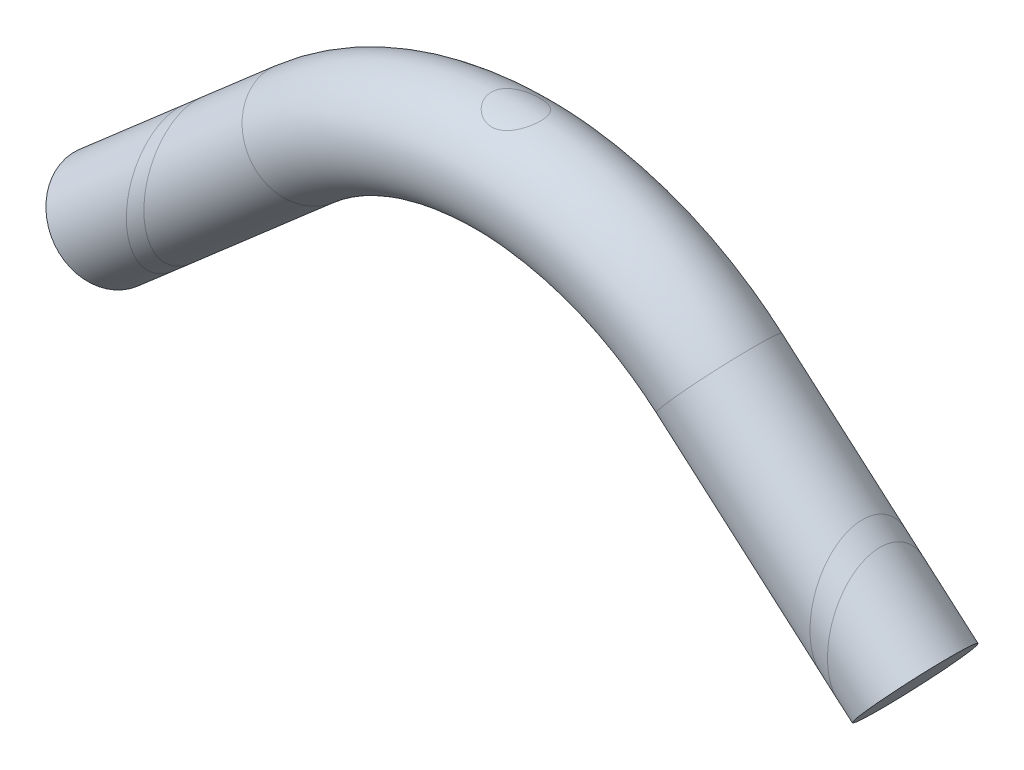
ISO-10303-21;
HEADER;
FILE_DESCRIPTION(('STEP AP214'),'2;1');
FILE_NAME('part.step','',(''),(''),'','','');
FILE_SCHEMA(('AUTOMOTIVE_DESIGN { 1 0 10303 214 1 1 1 1 }'));
ENDSEC;
DATA;
#1=APPLICATION_CONTEXT('core data for automotive mechanical design processes');
#2=APPLICATION_PROTOCOL_DEFINITION('international standard','automotive_design',2000,#1);
#3=PRODUCT_CONTEXT('',#1,'mechanical');
#4=PRODUCT('Part','Part','',(#3));
#5=PRODUCT_RELATED_PRODUCT_CATEGORY('part','',(#4));
#6=PRODUCT_DEFINITION_FORMATION('','',#4);
#7=PRODUCT_DEFINITION_CONTEXT('part definition',#1,'design');
#8=PRODUCT_DEFINITION('design','',#6,#7);
#9=PRODUCT_DEFINITION_SHAPE('','',#8);
#10=(LENGTH_UNIT() NAMED_UNIT(*) SI_UNIT(.MILLI.,.METRE.));
#11=(NAMED_UNIT(*) PLANE_ANGLE_UNIT() SI_UNIT($,.RADIAN.));
#12=(NAMED_UNIT(*) SI_UNIT($,.STERADIAN.) SOLID_ANGLE_UNIT());
#13=UNCERTAINTY_MEASURE_WITH_UNIT(LENGTH_MEASURE(1.E-05),#10,'distance_accuracy_value','');
#14=(GEOMETRIC_REPRESENTATION_CONTEXT(3) GLOBAL_UNCERTAINTY_ASSIGNED_CONTEXT((#13)) GLOBAL_UNIT_ASSIGNED_CONTEXT((#10,
#11,#12)) REPRESENTATION_CONTEXT('',''));
#15=CARTESIAN_POINT('',(0.,0.,0.));
#16=DIRECTION('',(0.,0.,1.));
#17=DIRECTION('',(1.,0.,0.));
#18=AXIS2_PLACEMENT_3D('',#15,#16,#17);
#19=CARTESIAN_POINT('',(174.056084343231,48.6468831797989,0.));
#20=DIRECTION('',(0.754605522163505,-0.656178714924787,0.));
#21=DIRECTION('',(0.656178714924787,0.754605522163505,0.));
#22=AXIS2_PLACEMENT_3D('',#19,#20,#21);
#23=CYLINDRICAL_SURFACE('',#22,15.);
#24=CARTESIAN_POINT('',(215.,13.0434782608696,0.));
#25=DIRECTION('',(1.,0.,0.));
#26=DIRECTION('',(0.,-1.,0.));
#27=AXIS2_PLACEMENT_3D('',#24,#25,#26);
#28=ELLIPSE('',#27,19.8779356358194,15.);
#29=CARTESIAN_POINT('',(215.,-6.8344573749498,0.));
#30=VERTEX_POINT('',#29);
#31=EDGE_CURVE('E44',#30,#30,#28,.F.);
#32=ORIENTED_EDGE('',*,*,#31,.F.);
#33=EDGE_LOOP('',(#32));
#34=FACE_BOUND('',#33,.T.);
#35=CARTESIAN_POINT('',(220.,8.69565217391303,0.));
#36=DIRECTION('',(1.,0.,0.));
#37=DIRECTION('',(0.,-1.,0.));
#38=AXIS2_PLACEMENT_3D('',#35,#36,#37);
#39=ELLIPSE('',#38,19.8779356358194,15.);
#40=CARTESIAN_POINT('',(220.,-11.1822834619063,0.));
#41=VERTEX_POINT('',#40);
#42=EDGE_CURVE('E10',#41,#41,#39,.F.);
#43=ORIENTED_EDGE('',*,*,#42,.T.);
#44=EDGE_LOOP('',(#43));
#45=FACE_BOUND('',#44,.T.);
#46=ADVANCED_FACE('F36',(#34,#45),#23,.T.);
#47=CARTESIAN_POINT('',(174.056084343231,48.6468831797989,0.));
#48=DIRECTION('',(0.754605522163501,-0.656178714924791,0.));
#49=DIRECTION('',(0.,0.,-1.));
#50=AXIS2_PLACEMENT_3D('',#47,#48,#49);
#51=CIRCLE('',#50,15.);
#52=CARTESIAN_POINT('',(174.056084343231,48.6468831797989,-15.));
#53=VERTEX_POINT('',#52);
#54=EDGE_CURVE('E118',#53,#53,#51,.T.);
#55=ORIENTED_EDGE('',*,*,#54,.T.);
#56=EDGE_LOOP('',(#55));
#57=FACE_BOUND('',#56,.T.);
#58=ORIENTED_EDGE('',*,*,#31,.T.);
#59=EDGE_LOOP('',(#58));
#60=FACE_BOUND('',#59,.T.);
#61=ADVANCED_FACE('F100',(#57,#60),#23,.T.);
#62=CARTESIAN_POINT('',(55.9439156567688,48.6468831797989,0.));
#63=DIRECTION('',(-0.754605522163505,-0.656178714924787,0.));
#64=DIRECTION('',(0.656178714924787,-0.754605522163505,0.));
#65=AXIS2_PLACEMENT_3D('',#62,#63,#64);
#66=CYLINDRICAL_SURFACE('',#65,15.);
#67=CARTESIAN_POINT('',(20.,17.3913043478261,0.));
#68=DIRECTION('',(1.,0.,0.));
#69=DIRECTION('',(0.,-1.,0.));
#70=AXIS2_PLACEMENT_3D('',#67,#68,#69);
#71=ELLIPSE('',#70,19.8779356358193,15.);
#72=CARTESIAN_POINT('',(20.,-2.48663128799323,0.));
#73=VERTEX_POINT('',#72);
#74=EDGE_CURVE('E59',#73,#73,#71,.T.);
#75=ORIENTED_EDGE('',*,*,#74,.T.);
#76=EDGE_LOOP('',(#75));
#77=FACE_BOUND('',#76,.T.);
#78=CARTESIAN_POINT('',(25.,21.7391304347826,0.));
#79=DIRECTION('',(1.,0.,0.));
#80=DIRECTION('',(0.,-1.,0.));
#81=AXIS2_PLACEMENT_3D('',#78,#79,#80);
#82=ELLIPSE('',#81,19.8779356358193,15.);
#83=CARTESIAN_POINT('',(25.,1.86119479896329,0.));
#84=VERTEX_POINT('',#83);
#85=EDGE_CURVE('E51',#84,#84,#82,.T.);
#86=ORIENTED_EDGE('',*,*,#85,.F.);
#87=EDGE_LOOP('',(#86));
#88=FACE_BOUND('',#87,.T.);
#89=ADVANCED_FACE('F90',(#77,#88),#66,.T.);
#90=CARTESIAN_POINT('',(0.,0.,0.));
#91=DIRECTION('',(0.7546055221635,0.656178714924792,0.));
#92=DIRECTION('',(0.,0.,-1.));
#93=AXIS2_PLACEMENT_3D('',#90,#91,#92);
#94=CIRCLE('',#93,15.);
#95=CARTESIAN_POINT('',(0.,0.,-15.));
#96=VERTEX_POINT('',#95);
#97=EDGE_CURVE('E72',#96,#96,#94,.T.);
#98=ORIENTED_EDGE('',*,*,#97,.T.);
#99=EDGE_LOOP('',(#98));
#100=FACE_BOUND('',#99,.T.);
#101=ORIENTED_EDGE('',*,*,#74,.F.);
#102=EDGE_LOOP('',(#101));
#103=FACE_BOUND('',#102,.T.);
#104=ADVANCED_FACE('F91',(#100,#103),#66,.T.);
#105=CARTESIAN_POINT('',(115.,-19.2676138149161,0.));
#106=DIRECTION('',(0.,0.,-1.));
#107=DIRECTION('',(-1.,0.,0.));
#108=AXIS2_PLACEMENT_3D('',#105,#106,#107);
#109=TOROIDAL_SURFACE('',#108,90.,15.);
#110=CARTESIAN_POINT('',(110.588080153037,85.0106860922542,-4.2962066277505));
#111=CARTESIAN_POINT('',(110.710333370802,84.9688042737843,-4.4534690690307));
#112=CARTESIAN_POINT('',(110.839197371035,84.9257780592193,-4.60537547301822));
#113=CARTESIAN_POINT('',(111.1092662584,84.8385685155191,-4.89755901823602));
#114=CARTESIAN_POINT('',(111.250478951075,84.7943844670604,-5.03782869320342));
#115=CARTESIAN_POINT('',(111.544722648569,84.7059378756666,-5.30620513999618));
#116=CARTESIAN_POINT('',(111.697783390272,84.6616754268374,-5.43427938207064));
#117=CARTESIAN_POINT('',(112.014505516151,84.5744150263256,-5.67705037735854));
#118=CARTESIAN_POINT('',(112.1781667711,84.5314170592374,-5.7917472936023));
#119=CARTESIAN_POINT('',(112.515366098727,84.4478828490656,-6.00711752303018));
#120=CARTESIAN_POINT('',(112.688915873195,84.4073496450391,-6.10777371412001));
#121=CARTESIAN_POINT('',(113.044595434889,84.3300760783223,-6.29406440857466));
#122=CARTESIAN_POINT('',(113.226720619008,84.2933337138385,-6.37970685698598));
#123=CARTESIAN_POINT('',(113.598324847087,84.2248607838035,-6.53519724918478));
#124=CARTESIAN_POINT('',(113.787797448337,84.1931259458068,-6.60505867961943));
#125=CARTESIAN_POINT('',(114.172914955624,84.1357511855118,-6.72834766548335));
#126=CARTESIAN_POINT('',(114.36855940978,84.1101108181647,-6.78177642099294));
#127=CARTESIAN_POINT('',(114.755652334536,84.0668680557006,-6.8695575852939));
#128=CARTESIAN_POINT('',(114.946897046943,84.0489574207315,-6.90465638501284));
#129=CARTESIAN_POINT('',(115.332170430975,84.020196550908,-6.95885151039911));
#130=CARTESIAN_POINT('',(115.526199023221,84.0093461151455,-6.97794829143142));
#131=CARTESIAN_POINT('',(115.915391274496,83.9950818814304,-6.99987763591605));
#132=CARTESIAN_POINT('',(116.110554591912,83.9916659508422,-7.00271486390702));
#133=CARTESIAN_POINT('',(116.500417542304,83.9923464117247,-6.99207973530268));
#134=CARTESIAN_POINT('',(116.695117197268,83.9964424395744,-6.97860816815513));
#135=CARTESIAN_POINT('',(117.067728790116,84.0113360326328,-6.93714730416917));
#136=CARTESIAN_POINT('',(117.245794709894,84.0216021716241,-6.91033566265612));
#137=CARTESIAN_POINT('',(117.598975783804,84.0479765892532,-6.84317181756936));
#138=CARTESIAN_POINT('',(117.774089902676,84.0640868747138,-6.80281496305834));
#139=CARTESIAN_POINT('',(118.120129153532,84.1015870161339,-6.70895336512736));
#140=CARTESIAN_POINT('',(118.291055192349,84.1229757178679,-6.65545149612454));
#141=CARTESIAN_POINT('',(118.627805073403,84.1703534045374,-6.53573510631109));
#142=CARTESIAN_POINT('',(118.793626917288,84.1963441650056,-6.46951567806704));
#143=CARTESIAN_POINT('',(119.123873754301,84.2529417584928,-6.3228119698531));
#144=CARTESIAN_POINT('',(119.28812184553,84.2836597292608,-6.24197261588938));
#145=CARTESIAN_POINT('',(119.609366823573,84.3482341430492,-6.06795742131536));
#146=CARTESIAN_POINT('',(119.766361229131,84.3820916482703,-5.97477740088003));
#147=CARTESIAN_POINT('',(120.072280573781,84.4520067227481,-5.7766867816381));
#148=CARTESIAN_POINT('',(120.221204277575,84.4880646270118,-5.67177439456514));
#149=CARTESIAN_POINT('',(120.510238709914,84.5614402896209,-5.4508349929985));
#150=CARTESIAN_POINT('',(120.65034900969,84.5987581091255,-5.33480743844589));
#151=CARTESIAN_POINT('',(120.9322498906,84.6768284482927,-5.08223563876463));
#152=CARTESIAN_POINT('',(121.073224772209,84.7176102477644,-4.94478843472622));
#153=CARTESIAN_POINT('',(121.343156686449,84.798425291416,-4.65844140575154));
#154=CARTESIAN_POINT('',(121.472117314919,84.8384587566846,-4.50954503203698));
#155=CARTESIAN_POINT('',(121.71730888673,84.9167306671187,-4.20103378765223));
#156=CARTESIAN_POINT('',(121.833533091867,84.9549681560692,-4.04141331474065));
#157=CARTESIAN_POINT('',(122.052303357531,85.0285885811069,-3.71252862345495));
#158=CARTESIAN_POINT('',(122.154855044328,85.0639726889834,-3.54326841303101));
#159=CARTESIAN_POINT('',(122.346717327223,85.1313755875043,-3.19392038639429));
#160=CARTESIAN_POINT('',(122.435847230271,85.1633470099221,-3.01372402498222));
#161=CARTESIAN_POINT('',(122.598482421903,85.2225141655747,-2.64573895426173));
#162=CARTESIAN_POINT('',(122.671994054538,85.2497118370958,-2.45795336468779));
#163=CARTESIAN_POINT('',(122.802698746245,85.2985764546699,-2.07611951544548));
#164=CARTESIAN_POINT('',(122.859894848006,85.320244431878,-1.88207243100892));
#165=CARTESIAN_POINT('',(122.957367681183,85.3574319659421,-1.48919977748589));
#166=CARTESIAN_POINT('',(122.997645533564,85.3729519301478,-1.29037452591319));
#167=CARTESIAN_POINT('',(123.058913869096,85.3966527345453,-0.901706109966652));
#168=CARTESIAN_POINT('',(123.080923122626,85.4052205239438,-0.712046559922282));
#169=CARTESIAN_POINT('',(123.109372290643,85.4163072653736,-0.331389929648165));
#170=CARTESIAN_POINT('',(123.115812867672,85.4188264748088,-0.140392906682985));
#171=CARTESIAN_POINT('',(123.113056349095,85.4177499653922,0.241433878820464));
#172=CARTESIAN_POINT('',(123.10386215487,85.4141553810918,0.432263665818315));
#173=CARTESIAN_POINT('',(123.069940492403,85.4009480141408,0.81232491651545));
#174=CARTESIAN_POINT('',(123.045213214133,85.391335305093,1.00155639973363));
#175=CARTESIAN_POINT('',(122.981706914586,85.3668148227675,1.36992080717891));
#176=CARTESIAN_POINT('',(122.943492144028,85.3521200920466,1.54916566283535));
#177=CARTESIAN_POINT('',(122.853261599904,85.3177364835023,1.90371771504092));
#178=CARTESIAN_POINT('',(122.801241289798,85.2980459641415,2.07902359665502));
#179=CARTESIAN_POINT('',(122.683878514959,85.2541417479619,2.42447362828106));
#180=CARTESIAN_POINT('',(122.618539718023,85.2299292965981,2.59461918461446));
#181=CARTESIAN_POINT('',(122.475036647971,85.1775264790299,2.92884814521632));
#182=CARTESIAN_POINT('',(122.396867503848,85.1493346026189,3.09292921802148));
#183=CARTESIAN_POINT('',(122.225485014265,85.0886207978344,3.41941645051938));
#184=CARTESIAN_POINT('',(122.131856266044,85.0559856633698,3.58158346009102));
#185=CARTESIAN_POINT('',(121.932185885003,84.9879273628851,3.89754163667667));
#186=CARTESIAN_POINT('',(121.826139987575,84.9525032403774,4.05132989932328));
#187=CARTESIAN_POINT('',(121.602331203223,84.8797145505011,4.34968686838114));
#188=CARTESIAN_POINT('',(121.484566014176,84.8423496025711,4.49425375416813));
#189=CARTESIAN_POINT('',(121.238034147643,84.7665831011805,4.77339229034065));
#190=CARTESIAN_POINT('',(121.109267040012,84.7281815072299,4.90796354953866));
#191=CARTESIAN_POINT('',(120.83296549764,84.6488510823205,5.17458545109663));
#192=CARTESIAN_POINT('',(120.68475926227,84.6079159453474,5.30593902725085));
#193=CARTESIAN_POINT('',(120.377627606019,84.5271266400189,5.55570944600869));
#194=CARTESIAN_POINT('',(120.218705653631,84.4872721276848,5.67413044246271));
#195=CARTESIAN_POINT('',(119.89091851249,84.4098115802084,5.89736247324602));
#196=CARTESIAN_POINT('',(119.722048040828,84.3722067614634,6.00216618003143));
#197=CARTESIAN_POINT('',(119.375507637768,84.3004965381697,6.19726639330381));
#198=CARTESIAN_POINT('',(119.197841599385,84.2663896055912,6.28756924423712));
#199=CARTESIAN_POINT('',(118.834269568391,84.2027551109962,6.45317700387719));
#200=CARTESIAN_POINT('',(118.648343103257,84.1732398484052,6.5284417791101));
#201=CARTESIAN_POINT('',(118.270045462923,84.1200229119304,6.6629125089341));
#202=CARTESIAN_POINT('',(118.077677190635,84.0963186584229,6.72212559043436));
#203=CARTESIAN_POINT('',(117.687969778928,84.0556852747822,6.82386208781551));
#204=CARTESIAN_POINT('',(117.490633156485,84.0387527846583,6.86639378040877));
#205=CARTESIAN_POINT('',(117.092538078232,84.01239764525,6.93429383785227));
#206=CARTESIAN_POINT('',(116.891779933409,84.0029743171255,6.95966375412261));
#207=CARTESIAN_POINT('',(116.504768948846,83.9925301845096,6.99159556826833));
#208=CARTESIAN_POINT('',(116.318642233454,83.990896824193,6.99950115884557));
#209=CARTESIAN_POINT('',(115.94641886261,83.9944771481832,7.00045299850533));
#210=CARTESIAN_POINT('',(115.760322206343,83.9996905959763,6.99349976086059));
#211=CARTESIAN_POINT('',(115.389592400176,84.0168226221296,6.96483359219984));
#212=CARTESIAN_POINT('',(115.204959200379,84.0287409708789,6.94312116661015));
#213=CARTESIAN_POINT('',(114.838509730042,84.0589036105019,6.88519875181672));
#214=CARTESIAN_POINT('',(114.656693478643,84.0771479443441,6.84898866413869));
#215=CARTESIAN_POINT('',(114.3028996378,84.1187028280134,6.76385396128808));
#216=CARTESIAN_POINT('',(114.130793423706,84.1418324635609,6.7153735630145));
#217=CARTESIAN_POINT('',(113.791370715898,84.1928110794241,6.60563055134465));
#218=CARTESIAN_POINT('',(113.624055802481,84.2206615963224,6.54436377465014));
#219=CARTESIAN_POINT('',(113.295192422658,84.2803103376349,6.40955658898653));
#220=CARTESIAN_POINT('',(113.133643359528,84.3121081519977,6.3360174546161));
#221=CARTESIAN_POINT('',(112.817077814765,84.3788300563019,6.17718672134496));
#222=CARTESIAN_POINT('',(112.66206372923,84.4137552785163,6.09189085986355));
#223=CARTESIAN_POINT('',(112.185889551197,84.527199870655,5.80590071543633));
#224=CARTESIAN_POINT('',(111.877636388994,84.6098627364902,5.58486502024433));
#225=CARTESIAN_POINT('',(111.300992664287,84.7771921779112,5.09626568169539));
#226=CARTESIAN_POINT('',(111.032618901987,84.8618595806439,4.82868253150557));
#227=CARTESIAN_POINT('',(110.656758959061,84.9868457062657,4.38774965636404));
#228=CARTESIAN_POINT('',(110.532732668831,85.0293850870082,4.22886253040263));
#229=CARTESIAN_POINT('',(110.298553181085,85.1116147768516,3.90051516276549));
#230=CARTESIAN_POINT('',(110.188394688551,85.1513061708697,3.73105899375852));
#231=CARTESIAN_POINT('',(109.982792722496,85.2267917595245,3.38255586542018));
#232=CARTESIAN_POINT('',(109.887353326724,85.2625848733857,3.20350626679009));
#233=CARTESIAN_POINT('',(109.712122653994,85.3292764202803,2.83712420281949));
#234=CARTESIAN_POINT('',(109.632323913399,85.3601771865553,2.64979574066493));
#235=CARTESIAN_POINT('',(109.491432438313,85.4153422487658,2.27427805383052));
#236=CARTESIAN_POINT('',(109.429820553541,85.4397880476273,2.08631035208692));
#237=CARTESIAN_POINT('',(109.322620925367,85.4826476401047,1.70526817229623));
#238=CARTESIAN_POINT('',(109.277026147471,85.5010640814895,1.51219597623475));
#239=CARTESIAN_POINT('',(109.202346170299,85.531371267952,1.12244027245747));
#240=CARTESIAN_POINT('',(109.173255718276,85.5432640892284,0.925757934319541));
#241=CARTESIAN_POINT('',(109.131906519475,85.5602014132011,0.53034304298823));
#242=CARTESIAN_POINT('',(109.119646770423,85.5652463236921,0.331610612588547));
#243=CARTESIAN_POINT('',(109.112361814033,85.5682422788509,-0.0525573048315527));
#244=CARTESIAN_POINT('',(109.116211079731,85.5666566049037,-0.237968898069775));
#245=CARTESIAN_POINT('',(109.138590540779,85.5574650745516,-0.607752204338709));
#246=CARTESIAN_POINT('',(109.157120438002,85.5498593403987,-0.792123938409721));
#247=CARTESIAN_POINT('',(109.208680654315,85.5288071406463,-1.15857657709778));
#248=CARTESIAN_POINT('',(109.241717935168,85.5153578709,-1.3406563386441));
#249=CARTESIAN_POINT('',(109.321961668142,85.4829410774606,-1.70115684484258));
#250=CARTESIAN_POINT('',(109.369167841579,85.4639736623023,-1.87957766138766));
#251=CARTESIAN_POINT('',(109.476837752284,85.4211512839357,-2.23007003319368));
#252=CARTESIAN_POINT('',(109.537184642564,85.397339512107,-2.40218284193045));
#253=CARTESIAN_POINT('',(109.670873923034,85.345256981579,-2.74067575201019));
#254=CARTESIAN_POINT('',(109.744222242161,85.3169841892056,-2.9070531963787));
#255=CARTESIAN_POINT('',(109.903134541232,85.2566806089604,-3.23268376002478));
#256=CARTESIAN_POINT('',(109.988671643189,85.2246581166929,-3.3919515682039));
#257=CARTESIAN_POINT('',(110.171469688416,85.157496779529,-3.70290615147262));
#258=CARTESIAN_POINT('',(110.268728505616,85.1223585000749,-3.85459429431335));
#259=CARTESIAN_POINT('',(110.406347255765,85.0737364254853,-4.05208266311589));
#260=CARTESIAN_POINT('',(110.441822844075,85.0612916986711,-4.10159895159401));
#261=CARTESIAN_POINT('',(110.514020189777,85.0361622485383,-4.1996455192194));
#262=CARTESIAN_POINT('',(110.550741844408,85.0234775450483,-4.248175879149));
#263=CARTESIAN_POINT('',(110.588080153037,85.0106860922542,-4.2962066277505));
#264=B_SPLINE_CURVE_WITH_KNOTS('',3,(#110,#111,#112,#113,#114,#115,#116,#117,#118,#119,#120,
#121,#122,#123,#124,#125,#126,#127,#128,#129,#130,#131,#132,#133,#134,#135,#136,#137,#138,#139,
#140,#141,#142,#143,#144,#145,#146,#147,#148,#149,#150,#151,#152,#153,#154,#155,#156,#157,#158,
#159,#160,#161,#162,#163,#164,#165,#166,#167,#168,#169,#170,#171,#172,#173,#174,#175,#176,#177,
#178,#179,#180,#181,#182,#183,#184,#185,#186,#187,#188,#189,#190,#191,#192,#193,#194,#195,#196,
#197,#198,#199,#200,#201,#202,#203,#204,#205,#206,#207,#208,#209,#210,#211,#212,#213,#214,#215,
#216,#217,#218,#219,#220,#221,#222,#223,#224,#225,#226,#227,#228,#229,#230,#231,#232,#233,#234,
#235,#236,#237,#238,#239,#240,#241,#242,#243,#244,#245,#246,#247,#248,#249,#250,#251,#252,#253,
#254,#255,#256,#257,#258,#259,#260,#261,#262,#263),.UNSPECIFIED.,.T.,.F.,(4,2,2,2,2,2,2,2,2,2,2,
2,2,2,2,2,2,2,2,2,2,2,2,2,2,2,2,2,2,2,2,2,2,2,2,2,2,2,2,2,2,2,2,2,2,2,2,2,2,2,2,2,2,2,2,2,2,2,2,
2,2,2,2,2,2,2,2,2,2,2,2,2,2,2,2,2,4),(0.,0.610583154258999,1.22155508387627,1.83411354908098,
2.44666454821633,3.05995611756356,3.67292215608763,4.28536234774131,4.89775780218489,
5.4827606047,6.06774675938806,6.65256508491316,7.23735510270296,7.77782479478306,
8.31848025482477,8.85901759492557,9.39976393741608,9.9560409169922,10.5125067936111,
11.0690576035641,11.6256354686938,12.2281490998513,12.8304818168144,13.433131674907,
14.0355327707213,14.6454316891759,15.2550823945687,15.8646193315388,16.4741158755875,
17.0467669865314,17.6193937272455,18.1919142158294,18.7644277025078,19.3153806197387,
19.8665148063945,20.4174974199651,20.9686896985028,21.5382990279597,22.1081045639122,
22.678022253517,23.2479622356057,23.8539298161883,24.4597021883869,25.0657991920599,
25.6716302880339,26.2790572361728,26.8862140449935,27.49306922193,28.0998695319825,
28.6580674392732,29.216246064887,29.7744055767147,30.3325688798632,30.8728608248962,
31.4133289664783,31.9537410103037,32.4943495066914,33.6537163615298,34.8135702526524,
35.4309340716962,36.0480614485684,36.6653594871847,37.2823622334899,37.879517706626,
38.4764105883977,39.0731133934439,39.6697806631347,40.2254808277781,40.7811697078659,
41.3371255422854,41.8930704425,42.4442602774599,42.9957021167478,43.5459462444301,
44.0960907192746,44.2825890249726,44.4690719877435),.UNSPECIFIED.);
#265=CARTESIAN_POINT('',(110.588080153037,85.0106860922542,-4.2962066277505));
#266=VERTEX_POINT('',#265);
#267=EDGE_CURVE('E65',#266,#266,#264,.T.);
#268=ORIENTED_EDGE('',*,*,#267,.T.);
#269=EDGE_LOOP('',(#268));
#270=FACE_BOUND('',#269,.T.);
#271=CARTESIAN_POINT('',(55.9439156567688,48.6468831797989,0.));
#272=DIRECTION('',(0.7546055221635,0.656178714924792,0.));
#273=DIRECTION('',(0.,0.,-1.));
#274=AXIS2_PLACEMENT_3D('',#271,#272,#273);
#275=CIRCLE('',#274,15.);
#276=CARTESIAN_POINT('',(55.9439156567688,48.6468831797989,-15.));
#277=VERTEX_POINT('',#276);
#278=EDGE_CURVE('E122',#277,#277,#275,.T.);
#279=ORIENTED_EDGE('',*,*,#278,.T.);
#280=EDGE_LOOP('',(#279));
#281=FACE_BOUND('',#280,.T.);
#282=ORIENTED_EDGE('',*,*,#54,.F.);
#283=EDGE_LOOP('',(#282));
#284=FACE_BOUND('',#283,.T.);
#285=CARTESIAN_POINT('',(109.933391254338,55.9260523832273,-3.28518633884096));
#286=CARTESIAN_POINT('',(109.850554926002,55.885405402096,-3.12933368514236));
#287=CARTESIAN_POINT('',(109.773418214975,55.8468356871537,-2.96996870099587));
#288=CARTESIAN_POINT('',(109.631107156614,55.7747094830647,-2.64490910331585));
#289=CARTESIAN_POINT('',(109.565928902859,55.7411513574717,-2.47921657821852));
#290=CARTESIAN_POINT('',(109.448105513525,55.6798497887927,-2.14230960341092));
#291=CARTESIAN_POINT('',(109.395465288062,55.6521086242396,-1.97109302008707));
#292=CARTESIAN_POINT('',(109.30331881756,55.6031764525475,-1.62431099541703));
#293=CARTESIAN_POINT('',(109.26380711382,55.5819827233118,-1.44874739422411));
#294=CARTESIAN_POINT('',(109.19823362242,55.5466375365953,-1.09376995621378));
#295=CARTESIAN_POINT('',(109.172219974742,55.5325112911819,-0.914344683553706));
#296=CARTESIAN_POINT('',(109.134183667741,55.5118103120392,-0.553578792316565));
#297=CARTESIAN_POINT('',(109.122161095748,55.5052356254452,-0.372238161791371));
#298=CARTESIAN_POINT('',(109.112266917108,55.4998269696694,-0.0090883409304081));
#299=CARTESIAN_POINT('',(109.114392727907,55.5009915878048,0.172720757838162));
#300=CARTESIAN_POINT('',(109.132761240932,55.5110249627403,0.535405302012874));
#301=CARTESIAN_POINT('',(109.149003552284,55.5198935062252,0.716280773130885));
#302=CARTESIAN_POINT('',(109.194351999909,55.5445161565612,1.06766132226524));
#303=CARTESIAN_POINT('',(109.222850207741,55.5599445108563,1.23826836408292));
#304=CARTESIAN_POINT('',(109.292221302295,55.5972131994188,1.57629228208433));
#305=CARTESIAN_POINT('',(109.333098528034,55.6190557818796,1.74370801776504));
#306=CARTESIAN_POINT('',(109.42678661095,55.6686122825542,2.07422933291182));
#307=CARTESIAN_POINT('',(109.479595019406,55.6963249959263,2.23733578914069));
#308=CARTESIAN_POINT('',(109.596671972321,55.7569884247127,2.55843976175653));
#309=CARTESIAN_POINT('',(109.660945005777,55.7899411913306,2.71643524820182));
#310=CARTESIAN_POINT('',(109.803620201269,55.8619713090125,3.03363393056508));
#311=CARTESIAN_POINT('',(109.882536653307,55.9012607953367,3.19255779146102));
#312=CARTESIAN_POINT('',(110.051700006,55.9838618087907,3.50319043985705));
#313=CARTESIAN_POINT('',(110.141950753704,56.0271747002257,3.65489675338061));
#314=CARTESIAN_POINT('',(110.428795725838,56.1617269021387,4.09820480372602));
#315=CARTESIAN_POINT('',(110.64154113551,56.2576102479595,4.37812457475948));
#316=CARTESIAN_POINT('',(111.132614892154,56.4651011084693,4.93278331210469));
#317=CARTESIAN_POINT('',(111.415692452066,56.5772406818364,5.20313606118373));
#318=CARTESIAN_POINT('',(111.871962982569,56.7405613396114,5.5711918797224));
#319=CARTESIAN_POINT('',(112.029453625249,56.794223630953,5.68770192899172));
#320=CARTESIAN_POINT('',(112.354438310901,56.8984238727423,5.90758204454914));
#321=CARTESIAN_POINT('',(112.521933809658,56.9489613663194,6.01095019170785));
#322=CARTESIAN_POINT('',(112.872765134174,57.0472016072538,6.20744543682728));
#323=CARTESIAN_POINT('',(113.056463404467,57.094718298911,6.30001960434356));
#324=CARTESIAN_POINT('',(113.432595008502,57.1829107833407,6.46909885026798));
#325=CARTESIAN_POINT('',(113.625023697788,57.2235901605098,6.54561235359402));
#326=CARTESIAN_POINT('',(114.017158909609,57.2964360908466,6.68159298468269));
#327=CARTESIAN_POINT('',(114.216857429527,57.3286117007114,6.74107825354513));
#328=CARTESIAN_POINT('',(114.622039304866,57.3830352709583,6.84220611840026));
#329=CARTESIAN_POINT('',(114.827521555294,57.4052851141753,6.88385209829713));
#330=CARTESIAN_POINT('',(115.217354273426,57.4367328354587,6.94471296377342));
#331=CARTESIAN_POINT('',(115.401279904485,57.4471770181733,6.96602063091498));
#332=CARTESIAN_POINT('',(115.770527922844,57.4590600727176,6.99398833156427));
#333=CARTESIAN_POINT('',(115.955850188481,57.460499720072,7.00064962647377));
#334=CARTESIAN_POINT('',(116.326238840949,57.4542531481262,6.99925059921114));
#335=CARTESIAN_POINT('',(116.51130527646,57.4465690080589,6.99119363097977));
#336=CARTESIAN_POINT('',(116.87963072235,57.4223125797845,6.96052483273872));
#337=CARTESIAN_POINT('',(117.062889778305,57.4057405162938,6.93791337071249));
#338=CARTESIAN_POINT('',(117.40965439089,57.3661480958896,6.88119790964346));
#339=CARTESIAN_POINT('',(117.573445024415,57.3438482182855,6.84832112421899));
#340=CARTESIAN_POINT('',(117.897363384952,57.2929767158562,6.77123078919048));
#341=CARTESIAN_POINT('',(118.057489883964,57.2644030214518,6.72701349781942));
#342=CARTESIAN_POINT('',(118.530994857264,57.1703626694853,6.5780281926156));
#343=CARTESIAN_POINT('',(118.837722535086,57.09654962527,6.45688942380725));
#344=CARTESIAN_POINT('',(119.453484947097,56.9264219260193,6.16267158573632));
#345=CARTESIAN_POINT('',(119.760383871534,56.8287055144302,5.98598162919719));
#346=CARTESIAN_POINT('',(120.342251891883,56.6241435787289,5.59026743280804));
#347=CARTESIAN_POINT('',(120.617198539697,56.5172917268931,5.37121371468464));
#348=CARTESIAN_POINT('',(121.167239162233,56.2882922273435,4.86110788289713));
#349=CARTESIAN_POINT('',(121.43702584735,56.1660858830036,4.56427808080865));
#350=CARTESIAN_POINT('',(121.801980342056,55.9919702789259,4.08586020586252));
#351=CARTESIAN_POINT('',(121.917064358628,55.9354349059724,3.92075668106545));
#352=CARTESIAN_POINT('',(122.13321618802,55.8268803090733,3.58010025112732));
#353=CARTESIAN_POINT('',(122.234282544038,55.7748615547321,3.40454626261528));
#354=CARTESIAN_POINT('',(122.421895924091,55.6765783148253,3.04301517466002));
#355=CARTESIAN_POINT('',(122.508361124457,55.6303466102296,2.85698665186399));
#356=CARTESIAN_POINT('',(122.665069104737,55.5454021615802,2.47665936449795));
#357=CARTESIAN_POINT('',(122.735320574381,55.5066853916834,2.28236509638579));
#358=CARTESIAN_POINT('',(122.858640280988,55.4380433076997,1.88705594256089));
#359=CARTESIAN_POINT('',(122.911722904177,55.4081106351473,1.68604684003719));
#360=CARTESIAN_POINT('',(122.999939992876,55.3580485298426,1.27893799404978));
#361=CARTESIAN_POINT('',(123.035077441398,55.337917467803,1.07283910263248));
#362=CARTESIAN_POINT('',(123.083559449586,55.3100574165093,0.6836250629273));
#363=CARTESIAN_POINT('',(123.099083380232,55.3010902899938,0.500866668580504));
#364=CARTESIAN_POINT('',(123.115726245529,55.2914748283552,0.134483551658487));
#365=CARTESIAN_POINT('',(123.116846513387,55.2908257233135,-0.0491410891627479));
#366=CARTESIAN_POINT('',(123.104667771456,55.2978648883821,-0.415711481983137));
#367=CARTESIAN_POINT('',(123.091371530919,55.3055515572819,-0.598657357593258));
#368=CARTESIAN_POINT('',(123.050555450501,55.329033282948,-0.962422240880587));
#369=CARTESIAN_POINT('',(123.02303577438,55.3448282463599,-1.1432412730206));
#370=CARTESIAN_POINT('',(122.956437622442,55.3827706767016,-1.48944929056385));
#371=CARTESIAN_POINT('',(122.918249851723,55.4044256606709,-1.65506455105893));
#372=CARTESIAN_POINT('',(122.830226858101,55.4538864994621,-1.98225207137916));
#373=CARTESIAN_POINT('',(122.780387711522,55.4816944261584,-2.14382294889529));
#374=CARTESIAN_POINT('',(122.614127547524,55.5734192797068,-2.62099858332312));
#375=CARTESIAN_POINT('',(122.480912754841,55.6456673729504,-2.92932741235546));
#376=CARTESIAN_POINT('',(122.16266660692,55.8123722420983,-3.54250955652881));
#377=CARTESIAN_POINT('',(121.974502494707,55.90808679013,-3.84537433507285));
#378=CARTESIAN_POINT('',(121.556607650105,56.1100774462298,-4.41704614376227));
#379=CARTESIAN_POINT('',(121.326848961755,56.2163606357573,-4.68583006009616));
#380=CARTESIAN_POINT('',(120.798507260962,56.4445796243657,-5.21713390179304));
#381=CARTESIAN_POINT('',(120.494899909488,56.5668001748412,-5.47459651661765));
#382=CARTESIAN_POINT('',(120.008454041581,56.7424748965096,-5.82045871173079));
#383=CARTESIAN_POINT('',(119.841013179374,56.7997921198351,-5.92908201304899));
#384=CARTESIAN_POINT('',(119.496356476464,56.9102842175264,-6.13219508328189));
#385=CARTESIAN_POINT('',(119.319139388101,56.9634585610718,-6.22668304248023));
#386=CARTESIAN_POINT('',(118.952475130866,57.064925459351,-6.40223813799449));
#387=CARTESIAN_POINT('',(118.762861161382,57.1131080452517,-6.48302105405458));
#388=CARTESIAN_POINT('',(118.375727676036,57.2016966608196,-6.62797561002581));
#389=CARTESIAN_POINT('',(118.178212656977,57.242107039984,-6.69215654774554));
#390=CARTESIAN_POINT('',(117.77690577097,57.3135602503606,-6.80294567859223));
#391=CARTESIAN_POINT('',(117.573121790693,57.3446143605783,-6.84957504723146));
#392=CARTESIAN_POINT('',(117.160904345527,57.3961027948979,-6.9245316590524));
#393=CARTESIAN_POINT('',(116.952471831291,57.4165392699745,-6.95286260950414));
#394=CARTESIAN_POINT('',(116.561845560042,57.4438989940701,-6.98806225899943));
#395=CARTESIAN_POINT('',(116.379967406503,57.4522895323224,-6.99733876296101));
#396=CARTESIAN_POINT('',(116.01585647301,57.4602593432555,-7.00167005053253));
#397=CARTESIAN_POINT('',(115.833623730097,57.4598394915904,-6.99672624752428));
#398=CARTESIAN_POINT('',(115.470348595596,57.4502660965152,-6.97266497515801));
#399=CARTESIAN_POINT('',(115.289306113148,57.4411132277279,-6.95354860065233));
#400=CARTESIAN_POINT('',(114.929866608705,57.4144750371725,-6.90140193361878));
#401=CARTESIAN_POINT('',(114.751469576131,57.3969897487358,-6.86837169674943));
#402=CARTESIAN_POINT('',(114.411640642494,57.3559320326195,-6.79175506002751));
#403=CARTESIAN_POINT('',(114.249926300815,57.332902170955,-6.74912422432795));
#404=CARTESIAN_POINT('',(113.93079648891,57.2809746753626,-6.65272483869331));
#405=CARTESIAN_POINT('',(113.77338247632,57.2520750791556,-6.59895256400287));
#406=CARTESIAN_POINT('',(113.308815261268,57.1577552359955,-6.4216209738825));
#407=CARTESIAN_POINT('',(113.009179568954,57.084693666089,-6.28201092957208));
#408=CARTESIAN_POINT('',(112.405896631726,56.9171793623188,-5.94780617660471));
#409=CARTESIAN_POINT('',(112.104980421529,56.821302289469,-5.74904499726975));
#410=CARTESIAN_POINT('',(111.538416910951,56.6230240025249,-5.30913801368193));
#411=CARTESIAN_POINT('',(111.272766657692,56.520623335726,-5.06799576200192));
#412=CARTESIAN_POINT('',(110.81267729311,56.3314986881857,-4.58113048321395));
#413=CARTESIAN_POINT('',(110.613472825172,56.2444556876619,-4.34000639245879));
#414=CARTESIAN_POINT('',(110.247901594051,56.0780784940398,-3.83139325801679));
#415=CARTESIAN_POINT('',(110.08153211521,55.9987436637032,-3.56390639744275));
#416=CARTESIAN_POINT('',(109.933391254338,55.9260523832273,-3.28518633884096));
#417=B_SPLINE_CURVE_WITH_KNOTS('',3,(#285,#286,#287,#288,#289,#290,#291,#292,#293,#294,#295,
#296,#297,#298,#299,#300,#301,#302,#303,#304,#305,#306,#307,#308,#309,#310,#311,#312,#313,#314,
#315,#316,#317,#318,#319,#320,#321,#322,#323,#324,#325,#326,#327,#328,#329,#330,#331,#332,#333,
#334,#335,#336,#337,#338,#339,#340,#341,#342,#343,#344,#345,#346,#347,#348,#349,#350,#351,#352,
#353,#354,#355,#356,#357,#358,#359,#360,#361,#362,#363,#364,#365,#366,#367,#368,#369,#370,#371,
#372,#373,#374,#375,#376,#377,#378,#379,#380,#381,#382,#383,#384,#385,#386,#387,#388,#389,#390,
#391,#392,#393,#394,#395,#396,#397,#398,#399,#400,#401,#402,#403,#404,#405,#406,#407,#408,#409,
#410,#411,#412,#413,#414,#415,#416),.UNSPECIFIED.,.T.,.F.,(4,2,2,2,2,2,2,2,2,2,2,2,2,2,2,2,2,2,
2,2,2,2,2,2,2,2,2,2,2,2,2,2,2,2,2,2,2,2,2,2,2,2,2,2,2,2,2,2,2,2,2,2,2,2,2,2,2,2,2,2,2,2,2,2,2,
4),(0.,0.543124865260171,1.08607199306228,1.62923140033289,2.17216468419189,2.7170212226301,
3.26188116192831,3.80664164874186,4.35138705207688,4.87176476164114,5.39232508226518,
5.91277866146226,6.43343647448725,6.97806685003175,7.52288258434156,8.61208418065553,
9.82792244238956,10.4367184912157,11.045603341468,11.6781116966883,12.3102874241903,
12.9417871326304,13.5731669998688,14.1287430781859,14.6842713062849,15.2396729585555,
15.7950605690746,16.3001162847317,16.8053388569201,17.8151062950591,18.913017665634,
20.0116957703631,21.2633135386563,21.8898263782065,22.5164042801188,23.1463846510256,
23.7760265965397,24.4051395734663,25.0341479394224,25.5843230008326,26.1344471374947,
26.6844656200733,27.2344777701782,27.7479016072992,28.2614985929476,29.2878984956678,
30.3911445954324,31.4951349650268,32.7382405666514,33.3606085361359,33.9830561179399,
34.6171511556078,35.2508903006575,35.8838623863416,36.5167061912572,37.0628864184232,
37.6090123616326,38.1550961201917,38.7011776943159,39.2070780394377,39.7131477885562,
40.7248046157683,41.8400535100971,42.9552089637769,43.9265900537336,44.8978907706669),.UNSPECIFIED.);
#418=CARTESIAN_POINT('',(109.933391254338,55.9260523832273,-3.28518633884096));
#419=VERTEX_POINT('',#418);
#420=EDGE_CURVE('E64',#419,#419,#417,.T.);
#421=ORIENTED_EDGE('',*,*,#420,.T.);
#422=EDGE_LOOP('',(#421));
#423=FACE_BOUND('',#422,.T.);
#424=ADVANCED_FACE('F85',(#270,#281,#284,#423),#109,.T.);
#425=ORIENTED_EDGE('',*,*,#420,.F.);
#426=EDGE_LOOP('',(#425));
#427=FACE_BOUND('',#426,.T.);
#428=ADVANCED_FACE('F84',(#427),#109,.T.);
#429=ORIENTED_EDGE('',*,*,#85,.T.);
#430=EDGE_LOOP('',(#429));
#431=FACE_BOUND('',#430,.T.);
#432=ORIENTED_EDGE('',*,*,#278,.F.);
#433=EDGE_LOOP('',(#432));
#434=FACE_BOUND('',#433,.T.);
#435=ADVANCED_FACE('F82',(#431,#434),#66,.T.);
#436=ORIENTED_EDGE('',*,*,#267,.F.);
#437=EDGE_LOOP('',(#436));
#438=FACE_BOUND('',#437,.T.);
#439=ADVANCED_FACE('F77',(#438),#109,.T.);
#440=CARTESIAN_POINT('',(0.,0.,0.));
#441=DIRECTION('',(0.7546055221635,0.656178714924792,0.));
#442=DIRECTION('',(0.,0.,-1.));
#443=AXIS2_PLACEMENT_3D('',#440,#441,#442);
#444=PLANE('',#443);
#445=ORIENTED_EDGE('',*,*,#97,.F.);
#446=EDGE_LOOP('',(#445));
#447=FACE_BOUND('',#446,.T.);
#448=ADVANCED_FACE('F81',(#447),#444,.F.);
#449=ORIENTED_EDGE('',*,*,#42,.F.);
#450=EDGE_LOOP('',(#449));
#451=FACE_BOUND('',#450,.T.);
#452=CARTESIAN_POINT('',(230.,0.,0.));
#453=DIRECTION('',(0.754605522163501,-0.656178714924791,0.));
#454=DIRECTION('',(0.,0.,-1.));
#455=AXIS2_PLACEMENT_3D('',#452,#453,#454);
#456=CIRCLE('',#455,15.);
#457=CARTESIAN_POINT('',(230.,0.,-15.));
#458=VERTEX_POINT('',#457);
#459=EDGE_CURVE('E120',#458,#458,#456,.T.);
#460=ORIENTED_EDGE('',*,*,#459,.F.);
#461=EDGE_LOOP('',(#460));
#462=FACE_BOUND('',#461,.T.);
#463=ADVANCED_FACE('F94',(#451,#462),#23,.T.);
#464=CARTESIAN_POINT('',(230.,0.,0.));
#465=DIRECTION('',(-0.754605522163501,0.656178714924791,0.));
#466=DIRECTION('',(0.,0.,-1.));
#467=AXIS2_PLACEMENT_3D('',#464,#465,#466);
#468=PLANE('',#467);
#469=ORIENTED_EDGE('',*,*,#459,.T.);
#470=EDGE_LOOP('',(#469));
#471=FACE_BOUND('',#470,.T.);
#472=ADVANCED_FACE('F98',(#471),#468,.F.);
#473=CLOSED_SHELL('',(#46,#61,#89,#104,#424,#428,#435,#439,#448,#463,#472));
#474=MANIFOLD_SOLID_BREP('B2',#473);
#475=ADVANCED_BREP_SHAPE_REPRESENTATION('',(#18,#474),#14);
#476=SHAPE_DEFINITION_REPRESENTATION(#9,#475);
ENDSEC;
END-ISO-10303-21;
